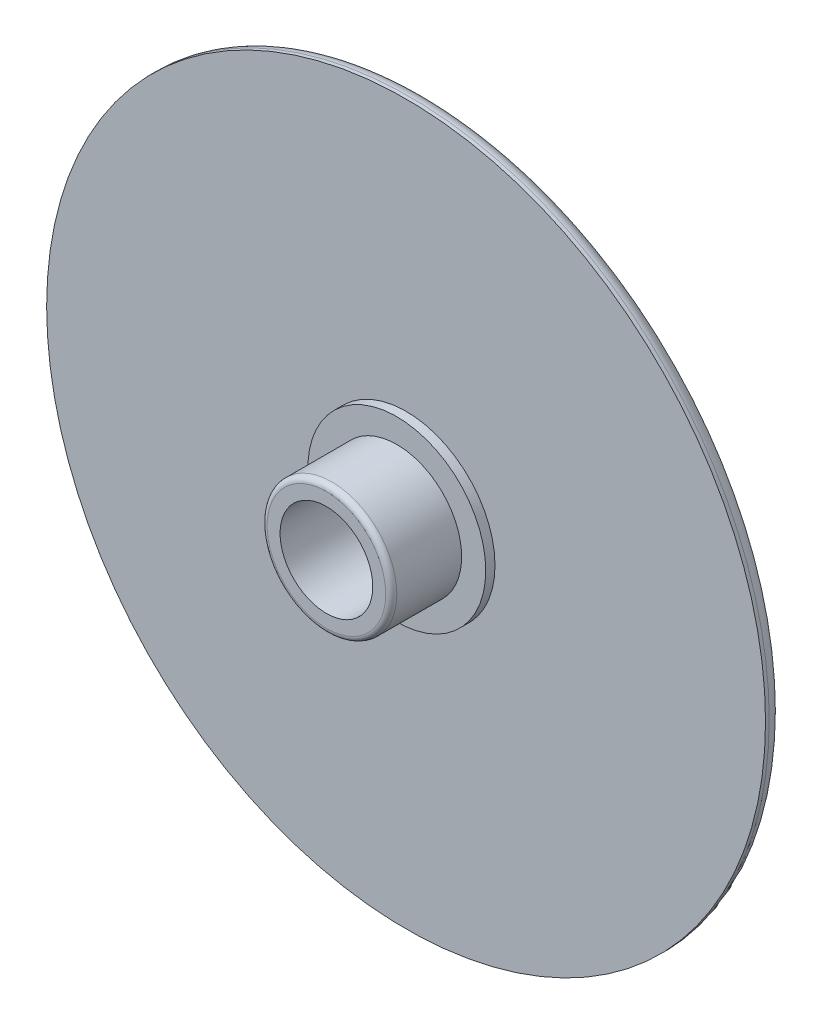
ISO-10303-21;
HEADER;
FILE_DESCRIPTION(('STEP AP214'),'2;1');
FILE_NAME('part.step','',(''),(''),'','','');
FILE_SCHEMA(('AUTOMOTIVE_DESIGN { 1 0 10303 214 1 1 1 1 }'));
ENDSEC;
DATA;
#1=APPLICATION_CONTEXT('core data for automotive mechanical design processes');
#2=APPLICATION_PROTOCOL_DEFINITION('international standard','automotive_design',2000,#1);
#3=PRODUCT_CONTEXT('',#1,'mechanical');
#4=PRODUCT('Part','Part','',(#3));
#5=PRODUCT_RELATED_PRODUCT_CATEGORY('part','',(#4));
#6=PRODUCT_DEFINITION_FORMATION('','',#4);
#7=PRODUCT_DEFINITION_CONTEXT('part definition',#1,'design');
#8=PRODUCT_DEFINITION('design','',#6,#7);
#9=PRODUCT_DEFINITION_SHAPE('','',#8);
#10=(LENGTH_UNIT() NAMED_UNIT(*) SI_UNIT(.MILLI.,.METRE.));
#11=(NAMED_UNIT(*) PLANE_ANGLE_UNIT() SI_UNIT($,.RADIAN.));
#12=(NAMED_UNIT(*) SI_UNIT($,.STERADIAN.) SOLID_ANGLE_UNIT());
#13=UNCERTAINTY_MEASURE_WITH_UNIT(LENGTH_MEASURE(1.E-05),#10,'distance_accuracy_value','');
#14=(GEOMETRIC_REPRESENTATION_CONTEXT(3) GLOBAL_UNCERTAINTY_ASSIGNED_CONTEXT((#13)) GLOBAL_UNIT_ASSIGNED_CONTEXT((#10,
#11,#12)) REPRESENTATION_CONTEXT('',''));
#15=CARTESIAN_POINT('',(0.,0.,0.));
#16=DIRECTION('',(0.,0.,1.));
#17=DIRECTION('',(1.,0.,0.));
#18=AXIS2_PLACEMENT_3D('',#15,#16,#17);
#19=CARTESIAN_POINT('',(0.,0.,1.5));
#20=DIRECTION('',(0.,0.,1.));
#21=DIRECTION('',(1.,0.,0.));
#22=AXIS2_PLACEMENT_3D('',#19,#20,#21);
#23=PLANE('',#22);
#24=CARTESIAN_POINT('',(0.,0.,1.5));
#25=DIRECTION('',(0.,0.,1.));
#26=DIRECTION('',(1.,0.,0.));
#27=AXIS2_PLACEMENT_3D('',#24,#25,#26);
#28=CIRCLE('',#27,4.8);
#29=CARTESIAN_POINT('',(4.8,0.,1.5));
#30=VERTEX_POINT('',#29);
#31=EDGE_CURVE('E371',#30,#30,#28,.T.);
#32=ORIENTED_EDGE('',*,*,#31,.T.);
#33=EDGE_LOOP('',(#32));
#34=FACE_BOUND('',#33,.T.);
#35=CARTESIAN_POINT('',(0.,0.,1.5));
#36=DIRECTION('',(0.,0.,1.));
#37=DIRECTION('',(1.,0.,0.));
#38=AXIS2_PLACEMENT_3D('',#35,#36,#37);
#39=CIRCLE('',#38,3.5);
#40=CARTESIAN_POINT('',(-3.5,0.,1.5));
#41=VERTEX_POINT('',#40);
#42=EDGE_CURVE('E377',#41,#41,#39,.T.);
#43=ORIENTED_EDGE('',*,*,#42,.F.);
#44=EDGE_LOOP('',(#43));
#45=FACE_BOUND('',#44,.T.);
#46=ADVANCED_FACE('F348',(#34,#45),#23,.T.);
#47=CARTESIAN_POINT('',(0.,0.,1.));
#48=DIRECTION('',(0.,0.,1.));
#49=DIRECTION('',(1.,0.,0.));
#50=AXIS2_PLACEMENT_3D('',#47,#48,#49);
#51=PLANE('',#50);
#52=CARTESIAN_POINT('',(0.,0.,1.));
#53=DIRECTION('',(0.,0.,1.));
#54=DIRECTION('',(1.,0.,0.));
#55=AXIS2_PLACEMENT_3D('',#52,#53,#54);
#56=CIRCLE('',#55,19.4);
#57=CARTESIAN_POINT('',(19.4,0.,1.));
#58=VERTEX_POINT('',#57);
#59=EDGE_CURVE('E368',#58,#58,#56,.T.);
#60=ORIENTED_EDGE('',*,*,#59,.T.);
#61=EDGE_LOOP('',(#60));
#62=FACE_BOUND('',#61,.T.);
#63=CARTESIAN_POINT('',(0.,0.,1.));
#64=DIRECTION('',(0.,0.,1.));
#65=DIRECTION('',(1.,0.,0.));
#66=AXIS2_PLACEMENT_3D('',#63,#64,#65);
#67=CIRCLE('',#66,4.8);
#68=CARTESIAN_POINT('',(4.8,0.,1.));
#69=VERTEX_POINT('',#68);
#70=EDGE_CURVE('E374',#69,#69,#67,.T.);
#71=ORIENTED_EDGE('',*,*,#70,.F.);
#72=EDGE_LOOP('',(#71));
#73=FACE_BOUND('',#72,.T.);
#74=ADVANCED_FACE('F403',(#62,#73),#51,.T.);
#75=CARTESIAN_POINT('',(0.,0.,1.));
#76=DIRECTION('',(0.,0.,-1.));
#77=DIRECTION('',(-1.,0.,0.));
#78=AXIS2_PLACEMENT_3D('',#75,#76,#77);
#79=CYLINDRICAL_SURFACE('',#78,19.4);
#80=CARTESIAN_POINT('',(0.,0.,0.8));
#81=DIRECTION('',(0.,0.,1.));
#82=DIRECTION('',(1.,0.,0.));
#83=AXIS2_PLACEMENT_3D('',#80,#81,#82);
#84=CIRCLE('',#83,19.4);
#85=CARTESIAN_POINT('',(19.4,0.,0.8));
#86=VERTEX_POINT('',#85);
#87=EDGE_CURVE('E363',#86,#86,#84,.T.);
#88=ORIENTED_EDGE('',*,*,#87,.T.);
#89=EDGE_LOOP('',(#88));
#90=FACE_BOUND('',#89,.T.);
#91=ORIENTED_EDGE('',*,*,#59,.F.);
#92=EDGE_LOOP('',(#91));
#93=FACE_BOUND('',#92,.T.);
#94=ADVANCED_FACE('F350',(#90,#93),#79,.T.);
#95=CARTESIAN_POINT('',(0.,0.,0.));
#96=DIRECTION('',(0.,0.,1.));
#97=DIRECTION('',(1.,0.,0.));
#98=AXIS2_PLACEMENT_3D('',#95,#96,#97);
#99=PLANE('',#98);
#100=CARTESIAN_POINT('',(0.,0.,0.));
#101=DIRECTION('',(0.,0.,1.));
#102=DIRECTION('',(1.,0.,0.));
#103=AXIS2_PLACEMENT_3D('',#100,#101,#102);
#104=CIRCLE('',#103,2.5);
#105=CARTESIAN_POINT('',(2.5,0.,0.));
#106=VERTEX_POINT('',#105);
#107=EDGE_CURVE('E380',#106,#106,#104,.T.);
#108=ORIENTED_EDGE('',*,*,#107,.T.);
#109=EDGE_LOOP('',(#108));
#110=FACE_BOUND('',#109,.T.);
#111=CARTESIAN_POINT('',(0.,0.,0.));
#112=DIRECTION('',(0.,0.,1.));
#113=DIRECTION('',(1.,0.,0.));
#114=AXIS2_PLACEMENT_3D('',#111,#112,#113);
#115=CIRCLE('',#114,18.6);
#116=CARTESIAN_POINT('',(18.6,0.,0.));
#117=VERTEX_POINT('',#116);
#118=EDGE_CURVE('E359',#117,#117,#115,.F.);
#119=ORIENTED_EDGE('',*,*,#118,.T.);
#120=EDGE_LOOP('',(#119));
#121=FACE_BOUND('',#120,.T.);
#122=ADVANCED_FACE('F418',(#110,#121),#99,.F.);
#123=CARTESIAN_POINT('',(0.,0.,0.8));
#124=DIRECTION('',(0.,0.,1.));
#125=DIRECTION('',(1.,0.,0.));
#126=AXIS2_PLACEMENT_3D('',#123,#124,#125);
#127=TOROIDAL_SURFACE('',#126,18.6,0.8);
#128=ORIENTED_EDGE('',*,*,#118,.F.);
#129=EDGE_LOOP('',(#128));
#130=FACE_BOUND('',#129,.T.);
#131=ORIENTED_EDGE('',*,*,#87,.F.);
#132=EDGE_LOOP('',(#131));
#133=FACE_BOUND('',#132,.T.);
#134=ADVANCED_FACE('F414',(#130,#133),#127,.T.);
#135=CARTESIAN_POINT('',(0.,0.,1.5));
#136=DIRECTION('',(0.,0.,-1.));
#137=DIRECTION('',(-1.,0.,0.));
#138=AXIS2_PLACEMENT_3D('',#135,#136,#137);
#139=CYLINDRICAL_SURFACE('',#138,4.8);
#140=ORIENTED_EDGE('',*,*,#31,.F.);
#141=EDGE_LOOP('',(#140));
#142=FACE_BOUND('',#141,.T.);
#143=ORIENTED_EDGE('',*,*,#70,.T.);
#144=EDGE_LOOP('',(#143));
#145=FACE_BOUND('',#144,.T.);
#146=ADVANCED_FACE('F400',(#142,#145),#139,.T.);
#147=CARTESIAN_POINT('',(0.,0.,5.3));
#148=DIRECTION('',(0.,0.,-1.));
#149=DIRECTION('',(-1.,0.,0.));
#150=AXIS2_PLACEMENT_3D('',#147,#148,#149);
#151=CYLINDRICAL_SURFACE('',#150,3.5);
#152=CARTESIAN_POINT('',(0.,0.,5.));
#153=DIRECTION('',(0.,0.,1.));
#154=DIRECTION('',(1.,0.,0.));
#155=AXIS2_PLACEMENT_3D('',#152,#153,#154);
#156=CIRCLE('',#155,3.5);
#157=CARTESIAN_POINT('',(-3.5,0.,5.));
#158=VERTEX_POINT('',#157);
#159=EDGE_CURVE('E10',#158,#158,#156,.F.);
#160=CARTESIAN_POINT('',(-3.5,0.,5.));
#161=CARTESIAN_POINT('',(-3.5,0.,4.96354166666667));
#162=CARTESIAN_POINT('',(-3.5,0.,4.92708333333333));
#163=CARTESIAN_POINT('',(-3.5,0.,4.85416666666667));
#164=CARTESIAN_POINT('',(-3.5,0.,4.81770833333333));
#165=CARTESIAN_POINT('',(-3.5,0.,4.74479166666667));
#166=CARTESIAN_POINT('',(-3.5,0.,4.70833333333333));
#167=CARTESIAN_POINT('',(-3.5,0.,4.63541666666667));
#168=CARTESIAN_POINT('',(-3.5,0.,4.59895833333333));
#169=CARTESIAN_POINT('',(-3.5,0.,4.52604166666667));
#170=CARTESIAN_POINT('',(-3.5,0.,4.48958333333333));
#171=CARTESIAN_POINT('',(-3.5,0.,4.41666666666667));
#172=CARTESIAN_POINT('',(-3.5,0.,4.38020833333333));
#173=CARTESIAN_POINT('',(-3.5,0.,4.30729166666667));
#174=CARTESIAN_POINT('',(-3.5,0.,4.27083333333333));
#175=CARTESIAN_POINT('',(-3.5,0.,4.19791666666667));
#176=CARTESIAN_POINT('',(-3.5,0.,4.16145833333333));
#177=CARTESIAN_POINT('',(-3.5,0.,4.08854166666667));
#178=CARTESIAN_POINT('',(-3.5,0.,4.05208333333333));
#179=CARTESIAN_POINT('',(-3.5,0.,3.97916666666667));
#180=CARTESIAN_POINT('',(-3.5,0.,3.94270833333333));
#181=CARTESIAN_POINT('',(-3.5,0.,3.86979166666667));
#182=CARTESIAN_POINT('',(-3.5,0.,3.83333333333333));
#183=CARTESIAN_POINT('',(-3.5,0.,3.76041666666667));
#184=CARTESIAN_POINT('',(-3.5,0.,3.72395833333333));
#185=CARTESIAN_POINT('',(-3.5,0.,3.65104166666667));
#186=CARTESIAN_POINT('',(-3.5,0.,3.61458333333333));
#187=CARTESIAN_POINT('',(-3.5,0.,3.54166666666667));
#188=CARTESIAN_POINT('',(-3.5,0.,3.50520833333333));
#189=CARTESIAN_POINT('',(-3.5,0.,3.43229166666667));
#190=CARTESIAN_POINT('',(-3.5,0.,3.39583333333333));
#191=CARTESIAN_POINT('',(-3.5,0.,3.32291666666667));
#192=CARTESIAN_POINT('',(-3.5,0.,3.28645833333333));
#193=CARTESIAN_POINT('',(-3.5,0.,3.21354166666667));
#194=CARTESIAN_POINT('',(-3.5,0.,3.17708333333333));
#195=CARTESIAN_POINT('',(-3.5,0.,3.10416666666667));
#196=CARTESIAN_POINT('',(-3.5,0.,3.06770833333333));
#197=CARTESIAN_POINT('',(-3.5,0.,2.99479166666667));
#198=CARTESIAN_POINT('',(-3.5,0.,2.95833333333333));
#199=CARTESIAN_POINT('',(-3.5,0.,2.88541666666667));
#200=CARTESIAN_POINT('',(-3.5,0.,2.84895833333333));
#201=CARTESIAN_POINT('',(-3.5,0.,2.77604166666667));
#202=CARTESIAN_POINT('',(-3.5,0.,2.73958333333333));
#203=CARTESIAN_POINT('',(-3.5,0.,2.66666666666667));
#204=CARTESIAN_POINT('',(-3.5,0.,2.63020833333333));
#205=CARTESIAN_POINT('',(-3.5,0.,2.55729166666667));
#206=CARTESIAN_POINT('',(-3.5,0.,2.52083333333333));
#207=CARTESIAN_POINT('',(-3.5,0.,2.44791666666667));
#208=CARTESIAN_POINT('',(-3.5,0.,2.41145833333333));
#209=CARTESIAN_POINT('',(-3.5,0.,2.33854166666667));
#210=CARTESIAN_POINT('',(-3.5,0.,2.30208333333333));
#211=CARTESIAN_POINT('',(-3.5,0.,2.22916666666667));
#212=CARTESIAN_POINT('',(-3.5,0.,2.19270833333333));
#213=CARTESIAN_POINT('',(-3.5,0.,2.11979166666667));
#214=CARTESIAN_POINT('',(-3.5,0.,2.08333333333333));
#215=CARTESIAN_POINT('',(-3.5,0.,2.01041666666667));
#216=CARTESIAN_POINT('',(-3.5,0.,1.97395833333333));
#217=CARTESIAN_POINT('',(-3.5,0.,1.90104166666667));
#218=CARTESIAN_POINT('',(-3.5,0.,1.86458333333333));
#219=CARTESIAN_POINT('',(-3.5,0.,1.79166666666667));
#220=CARTESIAN_POINT('',(-3.5,0.,1.75520833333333));
#221=CARTESIAN_POINT('',(-3.5,0.,1.68229166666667));
#222=CARTESIAN_POINT('',(-3.5,0.,1.64583333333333));
#223=CARTESIAN_POINT('',(-3.5,0.,1.57291666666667));
#224=CARTESIAN_POINT('',(-3.5,0.,1.53645833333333));
#225=CARTESIAN_POINT('',(-3.5,0.,1.5));
#226=B_SPLINE_CURVE_WITH_KNOTS('',3,(#160,#161,#162,#163,#164,#165,#166,#167,#168,#169,#170,
#171,#172,#173,#174,#175,#176,#177,#178,#179,#180,#181,#182,#183,#184,#185,#186,#187,#188,#189,
#190,#191,#192,#193,#194,#195,#196,#197,#198,#199,#200,#201,#202,#203,#204,#205,#206,#207,#208,
#209,#210,#211,#212,#213,#214,#215,#216,#217,#218,#219,#220,#221,#222,#223,#224,#225),
.UNSPECIFIED.,.F.,.F.,(4,2,2,2,2,2,2,2,2,2,2,2,2,2,2,2,2,2,2,2,2,2,2,2,2,2,2,2,2,2,2,2,4),(0.,
0.109375,0.21875,0.328125,0.4375,0.546875,0.656250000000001,0.765625,0.875,0.984375,1.09375,
1.203125,1.3125,1.421875,1.53125,1.640625,1.75,1.859375,1.96875,2.078125,2.1875,2.296875,
2.40625,2.515625,2.625,2.734375,2.84375,2.953125,3.0625,3.171875,3.28125,3.390625,3.5),.UNSPECIFIED.);
#227=EDGE_CURVE('BSEAM392',#158,#41,#226,.T.);
#228=ORIENTED_EDGE('',*,*,#159,.T.);
#229=ORIENTED_EDGE('',*,*,#42,.T.);
#230=ORIENTED_EDGE('',*,*,#227,.T.);
#231=ORIENTED_EDGE('',*,*,#227,.F.);
#232=EDGE_LOOP('',(#228,#230,#229,#231));
#233=FACE_BOUND('',#232,.T.);
#234=ADVANCED_FACE('F392',(#233),#151,.T.);
#235=CARTESIAN_POINT('',(0.,0.,5.3));
#236=DIRECTION('',(0.,0.,1.));
#237=DIRECTION('',(1.,0.,0.));
#238=AXIS2_PLACEMENT_3D('',#235,#236,#237);
#239=PLANE('',#238);
#240=CARTESIAN_POINT('',(0.,0.,5.3));
#241=DIRECTION('',(0.,0.,1.));
#242=DIRECTION('',(1.,0.,0.));
#243=AXIS2_PLACEMENT_3D('',#240,#241,#242);
#244=CIRCLE('',#243,2.5);
#245=CARTESIAN_POINT('',(2.5,0.,5.3));
#246=VERTEX_POINT('',#245);
#247=EDGE_CURVE('E383',#246,#246,#244,.T.);
#248=ORIENTED_EDGE('',*,*,#247,.F.);
#249=EDGE_LOOP('',(#248));
#250=FACE_BOUND('',#249,.T.);
#251=CARTESIAN_POINT('',(0.,0.,5.3));
#252=DIRECTION('',(0.,0.,1.));
#253=DIRECTION('',(1.,0.,0.));
#254=AXIS2_PLACEMENT_3D('',#251,#252,#253);
#255=CIRCLE('',#254,3.2);
#256=CARTESIAN_POINT('',(3.2,0.,5.3));
#257=VERTEX_POINT('',#256);
#258=EDGE_CURVE('E355',#257,#257,#255,.T.);
#259=ORIENTED_EDGE('',*,*,#258,.T.);
#260=EDGE_LOOP('',(#259));
#261=FACE_BOUND('',#260,.T.);
#262=ADVANCED_FACE('F389',(#250,#261),#239,.T.);
#263=CARTESIAN_POINT('',(0.,0.,5.));
#264=DIRECTION('',(0.,0.,1.));
#265=DIRECTION('',(1.,0.,0.));
#266=AXIS2_PLACEMENT_3D('',#263,#264,#265);
#267=TOROIDAL_SURFACE('',#266,3.2,0.3);
#268=ORIENTED_EDGE('',*,*,#159,.F.);
#269=EDGE_LOOP('',(#268));
#270=FACE_BOUND('',#269,.T.);
#271=ORIENTED_EDGE('',*,*,#258,.F.);
#272=EDGE_LOOP('',(#271));
#273=FACE_BOUND('',#272,.T.);
#274=ADVANCED_FACE('F391',(#270,#273),#267,.T.);
#275=CARTESIAN_POINT('',(0.,0.,0.));
#276=DIRECTION('',(0.,0.,1.));
#277=DIRECTION('',(1.,0.,0.));
#278=AXIS2_PLACEMENT_3D('',#275,#276,#277);
#279=CYLINDRICAL_SURFACE('',#278,2.5);
#280=ORIENTED_EDGE('',*,*,#107,.F.);
#281=EDGE_LOOP('',(#280));
#282=FACE_BOUND('',#281,.T.);
#283=ORIENTED_EDGE('',*,*,#247,.T.);
#284=EDGE_LOOP('',(#283));
#285=FACE_BOUND('',#284,.T.);
#286=ADVANCED_FACE('F387',(#282,#285),#279,.F.);
#287=CLOSED_SHELL('',(#46,#74,#94,#122,#134,#146,#234,#262,#274,#286));
#288=MANIFOLD_SOLID_BREP('B2',#287);
#289=ADVANCED_BREP_SHAPE_REPRESENTATION('',(#18,#288),#14);
#290=SHAPE_DEFINITION_REPRESENTATION(#9,#289);
ENDSEC;
END-ISO-10303-21;
